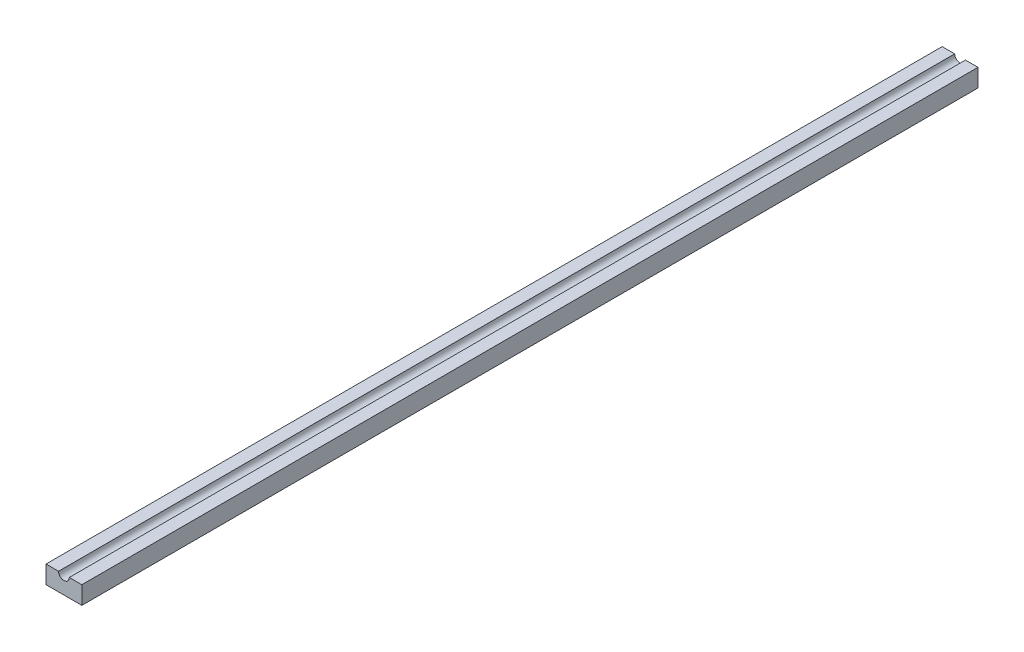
ISO-10303-21;
HEADER;
FILE_DESCRIPTION(('STEP AP214'),'2;1');
FILE_NAME('part.step','',(''),(''),'','','');
FILE_SCHEMA(('AUTOMOTIVE_DESIGN { 1 0 10303 214 1 1 1 1 }'));
ENDSEC;
DATA;
#1=APPLICATION_CONTEXT('core data for automotive mechanical design processes');
#2=APPLICATION_PROTOCOL_DEFINITION('international standard','automotive_design',2000,#1);
#3=PRODUCT_CONTEXT('',#1,'mechanical');
#4=PRODUCT('Part','Part','',(#3));
#5=PRODUCT_RELATED_PRODUCT_CATEGORY('part','',(#4));
#6=PRODUCT_DEFINITION_FORMATION('','',#4);
#7=PRODUCT_DEFINITION_CONTEXT('part definition',#1,'design');
#8=PRODUCT_DEFINITION('design','',#6,#7);
#9=PRODUCT_DEFINITION_SHAPE('','',#8);
#10=(LENGTH_UNIT() NAMED_UNIT(*) SI_UNIT(.MILLI.,.METRE.));
#11=(NAMED_UNIT(*) PLANE_ANGLE_UNIT() SI_UNIT($,.RADIAN.));
#12=(NAMED_UNIT(*) SI_UNIT($,.STERADIAN.) SOLID_ANGLE_UNIT());
#13=UNCERTAINTY_MEASURE_WITH_UNIT(LENGTH_MEASURE(1.E-05),#10,'distance_accuracy_value','');
#14=(GEOMETRIC_REPRESENTATION_CONTEXT(3) GLOBAL_UNCERTAINTY_ASSIGNED_CONTEXT((#13)) GLOBAL_UNIT_ASSIGNED_CONTEXT((#10,
#11,#12)) REPRESENTATION_CONTEXT('',''));
#15=CARTESIAN_POINT('',(0.,0.,0.));
#16=DIRECTION('',(0.,0.,1.));
#17=DIRECTION('',(1.,0.,0.));
#18=AXIS2_PLACEMENT_3D('',#15,#16,#17);
#19=CARTESIAN_POINT('',(0.,10.,0.));
#20=DIRECTION('',(0.,0.,1.));
#21=DIRECTION('',(1.,0.,0.));
#22=AXIS2_PLACEMENT_3D('',#19,#20,#21);
#23=CYLINDRICAL_SURFACE('',#22,3.);
#24=DIRECTION('',(0.,0.,1.));
#25=VECTOR('',#24,1.);
#26=CARTESIAN_POINT('',(3.00000000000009,10.,0.));
#27=LINE('',#26,#25);
#28=CARTESIAN_POINT('',(3.00000000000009,10.,0.));
#29=VERTEX_POINT('',#28);
#30=CARTESIAN_POINT('',(3.00000000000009,10.,500.));
#31=VERTEX_POINT('',#30);
#32=EDGE_CURVE('E9',#29,#31,#27,.T.);
#33=ORIENTED_EDGE('',*,*,#32,.F.);
#34=CARTESIAN_POINT('',(0.,10.,0.));
#35=DIRECTION('',(0.,0.,1.));
#36=DIRECTION('',(1.,0.,0.));
#37=AXIS2_PLACEMENT_3D('',#34,#35,#36);
#38=CIRCLE('',#37,3.);
#39=CARTESIAN_POINT('',(-3.,10.,0.));
#40=VERTEX_POINT('',#39);
#41=EDGE_CURVE('E95',#40,#29,#38,.T.);
#42=ORIENTED_EDGE('',*,*,#41,.F.);
#43=DIRECTION('',(0.,0.,1.));
#44=VECTOR('',#43,1.);
#45=CARTESIAN_POINT('',(-3.,10.,0.));
#46=LINE('',#45,#44);
#47=CARTESIAN_POINT('',(-3.,10.,500.));
#48=VERTEX_POINT('',#47);
#49=EDGE_CURVE('E29',#40,#48,#46,.T.);
#50=ORIENTED_EDGE('',*,*,#49,.T.);
#51=CARTESIAN_POINT('',(0.,10.,500.));
#52=DIRECTION('',(0.,0.,1.));
#53=DIRECTION('',(1.,0.,0.));
#54=AXIS2_PLACEMENT_3D('',#51,#52,#53);
#55=CIRCLE('',#54,3.);
#56=EDGE_CURVE('E77',#48,#31,#55,.T.);
#57=ORIENTED_EDGE('',*,*,#56,.T.);
#58=EDGE_LOOP('',(#33,#42,#50,#57));
#59=FACE_BOUND('',#58,.T.);
#60=ADVANCED_FACE('F14',(#59),#23,.F.);
#61=CARTESIAN_POINT('',(10.,10.,0.));
#62=DIRECTION('',(0.,1.,0.));
#63=DIRECTION('',(-1.,0.,0.));
#64=AXIS2_PLACEMENT_3D('',#61,#62,#63);
#65=PLANE('',#64);
#66=DIRECTION('',(0.,0.,1.));
#67=VECTOR('',#66,1.);
#68=CARTESIAN_POINT('',(10.,10.,0.));
#69=LINE('',#68,#67);
#70=CARTESIAN_POINT('',(10.,10.,0.));
#71=VERTEX_POINT('',#70);
#72=CARTESIAN_POINT('',(10.,10.,500.));
#73=VERTEX_POINT('',#72);
#74=EDGE_CURVE('E22',#71,#73,#69,.T.);
#75=ORIENTED_EDGE('',*,*,#74,.F.);
#76=DIRECTION('',(-1.,0.,0.));
#77=VECTOR('',#76,1.);
#78=CARTESIAN_POINT('',(10.,10.,0.));
#79=LINE('',#78,#77);
#80=EDGE_CURVE('E73',#71,#29,#79,.T.);
#81=ORIENTED_EDGE('',*,*,#80,.T.);
#82=ORIENTED_EDGE('',*,*,#32,.T.);
#83=DIRECTION('',(-1.,0.,0.));
#84=VECTOR('',#83,1.);
#85=CARTESIAN_POINT('',(10.,10.,500.));
#86=LINE('',#85,#84);
#87=EDGE_CURVE('E70',#73,#31,#86,.T.);
#88=ORIENTED_EDGE('',*,*,#87,.F.);
#89=EDGE_LOOP('',(#75,#81,#82,#88));
#90=FACE_BOUND('',#89,.T.);
#91=ADVANCED_FACE('F16',(#90),#65,.T.);
#92=CARTESIAN_POINT('',(10.,0.,0.));
#93=DIRECTION('',(1.,0.,0.));
#94=DIRECTION('',(0.,0.,-1.));
#95=AXIS2_PLACEMENT_3D('',#92,#93,#94);
#96=PLANE('',#95);
#97=DIRECTION('',(0.,0.,1.));
#98=VECTOR('',#97,1.);
#99=CARTESIAN_POINT('',(10.,0.,0.));
#100=LINE('',#99,#98);
#101=CARTESIAN_POINT('',(10.,0.,0.));
#102=VERTEX_POINT('',#101);
#103=CARTESIAN_POINT('',(10.,0.,500.));
#104=VERTEX_POINT('',#103);
#105=EDGE_CURVE('E112',#102,#104,#100,.T.);
#106=ORIENTED_EDGE('',*,*,#105,.F.);
#107=DIRECTION('',(0.,1.,0.));
#108=VECTOR('',#107,1.);
#109=CARTESIAN_POINT('',(10.,0.,0.));
#110=LINE('',#109,#108);
#111=EDGE_CURVE('E98',#102,#71,#110,.T.);
#112=ORIENTED_EDGE('',*,*,#111,.T.);
#113=ORIENTED_EDGE('',*,*,#74,.T.);
#114=DIRECTION('',(0.,1.,0.));
#115=VECTOR('',#114,1.);
#116=CARTESIAN_POINT('',(10.,0.,500.));
#117=LINE('',#116,#115);
#118=EDGE_CURVE('E84',#104,#73,#117,.T.);
#119=ORIENTED_EDGE('',*,*,#118,.F.);
#120=EDGE_LOOP('',(#106,#112,#113,#119));
#121=FACE_BOUND('',#120,.T.);
#122=ADVANCED_FACE('F114',(#121),#96,.T.);
#123=CARTESIAN_POINT('',(-10.,0.,0.));
#124=DIRECTION('',(0.,-1.,0.));
#125=DIRECTION('',(0.,0.,-1.));
#126=AXIS2_PLACEMENT_3D('',#123,#124,#125);
#127=PLANE('',#126);
#128=DIRECTION('',(0.,0.,1.));
#129=VECTOR('',#128,1.);
#130=CARTESIAN_POINT('',(-10.,0.,0.));
#131=LINE('',#130,#129);
#132=CARTESIAN_POINT('',(-10.,0.,0.));
#133=VERTEX_POINT('',#132);
#134=CARTESIAN_POINT('',(-10.,0.,500.));
#135=VERTEX_POINT('',#134);
#136=EDGE_CURVE('E110',#133,#135,#131,.T.);
#137=ORIENTED_EDGE('',*,*,#136,.F.);
#138=DIRECTION('',(1.,0.,0.));
#139=VECTOR('',#138,1.);
#140=CARTESIAN_POINT('',(-10.,0.,0.));
#141=LINE('',#140,#139);
#142=EDGE_CURVE('E101',#133,#102,#141,.T.);
#143=ORIENTED_EDGE('',*,*,#142,.T.);
#144=ORIENTED_EDGE('',*,*,#105,.T.);
#145=DIRECTION('',(1.,0.,0.));
#146=VECTOR('',#145,1.);
#147=CARTESIAN_POINT('',(-10.,0.,500.));
#148=LINE('',#147,#146);
#149=EDGE_CURVE('E86',#135,#104,#148,.T.);
#150=ORIENTED_EDGE('',*,*,#149,.F.);
#151=EDGE_LOOP('',(#137,#143,#144,#150));
#152=FACE_BOUND('',#151,.T.);
#153=ADVANCED_FACE('F124',(#152),#127,.T.);
#154=CARTESIAN_POINT('',(-10.,10.,0.));
#155=DIRECTION('',(-1.,0.,0.));
#156=DIRECTION('',(0.,0.,1.));
#157=AXIS2_PLACEMENT_3D('',#154,#155,#156);
#158=PLANE('',#157);
#159=DIRECTION('',(0.,0.,1.));
#160=VECTOR('',#159,1.);
#161=CARTESIAN_POINT('',(-10.,10.,0.));
#162=LINE('',#161,#160);
#163=CARTESIAN_POINT('',(-10.,10.,0.));
#164=VERTEX_POINT('',#163);
#165=CARTESIAN_POINT('',(-10.,10.,500.));
#166=VERTEX_POINT('',#165);
#167=EDGE_CURVE('E37',#164,#166,#162,.T.);
#168=ORIENTED_EDGE('',*,*,#167,.F.);
#169=DIRECTION('',(0.,-1.,0.));
#170=VECTOR('',#169,1.);
#171=CARTESIAN_POINT('',(-10.,10.,0.));
#172=LINE('',#171,#170);
#173=EDGE_CURVE('E104',#164,#133,#172,.T.);
#174=ORIENTED_EDGE('',*,*,#173,.T.);
#175=ORIENTED_EDGE('',*,*,#136,.T.);
#176=DIRECTION('',(0.,-1.,0.));
#177=VECTOR('',#176,1.);
#178=CARTESIAN_POINT('',(-10.,10.,500.));
#179=LINE('',#178,#177);
#180=EDGE_CURVE('E90',#166,#135,#179,.T.);
#181=ORIENTED_EDGE('',*,*,#180,.F.);
#182=EDGE_LOOP('',(#168,#174,#175,#181));
#183=FACE_BOUND('',#182,.T.);
#184=ADVANCED_FACE('F121',(#183),#158,.T.);
#185=CARTESIAN_POINT('',(-3.,10.,0.));
#186=DIRECTION('',(0.,1.,0.));
#187=DIRECTION('',(0.,0.,1.));
#188=AXIS2_PLACEMENT_3D('',#185,#186,#187);
#189=PLANE('',#188);
#190=DIRECTION('',(-1.,0.,0.));
#191=VECTOR('',#190,1.);
#192=CARTESIAN_POINT('',(-3.,10.,0.));
#193=LINE('',#192,#191);
#194=EDGE_CURVE('E106',#40,#164,#193,.T.);
#195=ORIENTED_EDGE('',*,*,#194,.T.);
#196=ORIENTED_EDGE('',*,*,#167,.T.);
#197=DIRECTION('',(-1.,0.,0.));
#198=VECTOR('',#197,1.);
#199=CARTESIAN_POINT('',(-3.,10.,500.));
#200=LINE('',#199,#198);
#201=EDGE_CURVE('E93',#48,#166,#200,.T.);
#202=ORIENTED_EDGE('',*,*,#201,.F.);
#203=ORIENTED_EDGE('',*,*,#49,.F.);
#204=EDGE_LOOP('',(#195,#196,#202,#203));
#205=FACE_BOUND('',#204,.T.);
#206=ADVANCED_FACE('F120',(#205),#189,.T.);
#207=CARTESIAN_POINT('',(0.,10.,0.));
#208=DIRECTION('',(0.,0.,1.));
#209=DIRECTION('',(1.,0.,0.));
#210=AXIS2_PLACEMENT_3D('',#207,#208,#209);
#211=PLANE('',#210);
#212=ORIENTED_EDGE('',*,*,#41,.T.);
#213=ORIENTED_EDGE('',*,*,#80,.F.);
#214=ORIENTED_EDGE('',*,*,#111,.F.);
#215=ORIENTED_EDGE('',*,*,#142,.F.);
#216=ORIENTED_EDGE('',*,*,#173,.F.);
#217=ORIENTED_EDGE('',*,*,#194,.F.);
#218=EDGE_LOOP('',(#212,#213,#214,#215,#216,#217));
#219=FACE_BOUND('',#218,.T.);
#220=ADVANCED_FACE('F117',(#219),#211,.F.);
#221=CARTESIAN_POINT('',(0.,10.,500.));
#222=DIRECTION('',(0.,0.,1.));
#223=DIRECTION('',(1.,0.,0.));
#224=AXIS2_PLACEMENT_3D('',#221,#222,#223);
#225=PLANE('',#224);
#226=ORIENTED_EDGE('',*,*,#56,.F.);
#227=ORIENTED_EDGE('',*,*,#201,.T.);
#228=ORIENTED_EDGE('',*,*,#180,.T.);
#229=ORIENTED_EDGE('',*,*,#149,.T.);
#230=ORIENTED_EDGE('',*,*,#118,.T.);
#231=ORIENTED_EDGE('',*,*,#87,.T.);
#232=EDGE_LOOP('',(#226,#227,#228,#229,#230,#231));
#233=FACE_BOUND('',#232,.T.);
#234=ADVANCED_FACE('F81',(#233),#225,.T.);
#235=CLOSED_SHELL('',(#60,#91,#122,#153,#184,#206,#220,#234));
#236=MANIFOLD_SOLID_BREP('B1',#235);
#237=ADVANCED_BREP_SHAPE_REPRESENTATION('',(#18,#236),#14);
#238=SHAPE_DEFINITION_REPRESENTATION(#9,#237);
ENDSEC;
END-ISO-10303-21;
